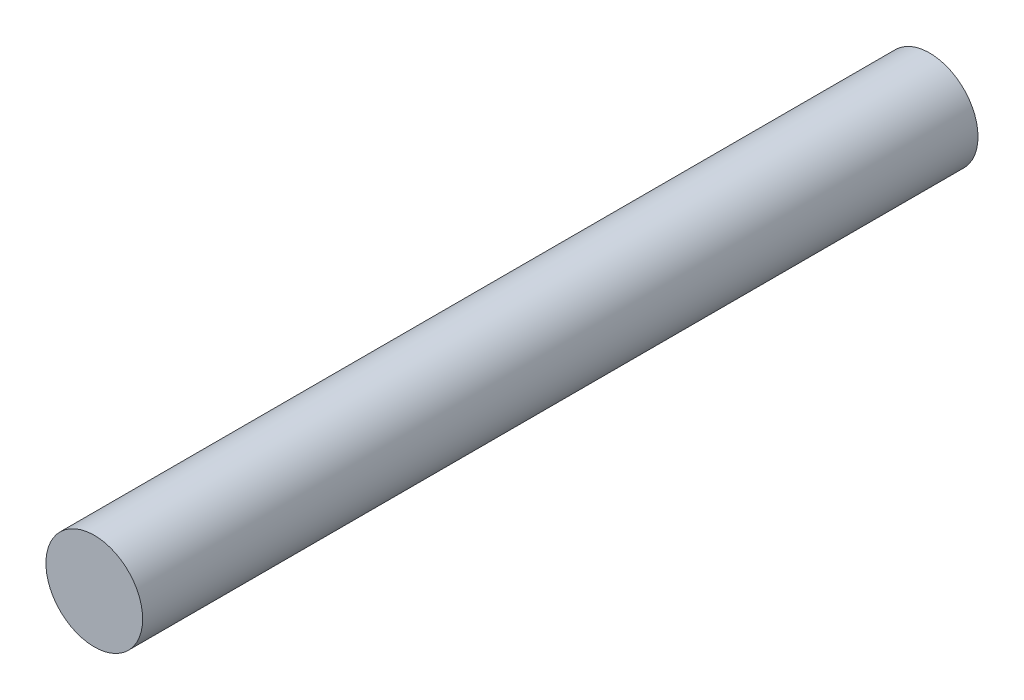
ISO-10303-21;
HEADER;
FILE_DESCRIPTION(('STEP AP214'),'2;1');
FILE_NAME('part.step','',(''),(''),'','','');
FILE_SCHEMA(('AUTOMOTIVE_DESIGN { 1 0 10303 214 1 1 1 1 }'));
ENDSEC;
DATA;
#1=APPLICATION_CONTEXT('core data for automotive mechanical design processes');
#2=APPLICATION_PROTOCOL_DEFINITION('international standard','automotive_design',2000,#1);
#3=PRODUCT_CONTEXT('',#1,'mechanical');
#4=PRODUCT('Part','Part','',(#3));
#5=PRODUCT_RELATED_PRODUCT_CATEGORY('part','',(#4));
#6=PRODUCT_DEFINITION_FORMATION('','',#4);
#7=PRODUCT_DEFINITION_CONTEXT('part definition',#1,'design');
#8=PRODUCT_DEFINITION('design','',#6,#7);
#9=PRODUCT_DEFINITION_SHAPE('','',#8);
#10=(LENGTH_UNIT() NAMED_UNIT(*) SI_UNIT(.MILLI.,.METRE.));
#11=(NAMED_UNIT(*) PLANE_ANGLE_UNIT() SI_UNIT($,.RADIAN.));
#12=(NAMED_UNIT(*) SI_UNIT($,.STERADIAN.) SOLID_ANGLE_UNIT());
#13=UNCERTAINTY_MEASURE_WITH_UNIT(LENGTH_MEASURE(1.E-05),#10,'distance_accuracy_value','');
#14=(GEOMETRIC_REPRESENTATION_CONTEXT(3) GLOBAL_UNCERTAINTY_ASSIGNED_CONTEXT((#13)) GLOBAL_UNIT_ASSIGNED_CONTEXT((#10,
#11,#12)) REPRESENTATION_CONTEXT('',''));
#15=CARTESIAN_POINT('',(0.,0.,0.));
#16=DIRECTION('',(0.,0.,1.));
#17=DIRECTION('',(1.,0.,0.));
#18=AXIS2_PLACEMENT_3D('',#15,#16,#17);
#19=CARTESIAN_POINT('',(0.,0.,19.));
#20=DIRECTION('',(0.,0.,-1.));
#21=DIRECTION('',(-1.,0.,0.));
#22=AXIS2_PLACEMENT_3D('',#19,#20,#21);
#23=CYLINDRICAL_SURFACE('',#22,1.1);
#24=CARTESIAN_POINT('',(0.,0.,19.));
#25=DIRECTION('',(0.,0.,1.));
#26=DIRECTION('',(1.,0.,0.));
#27=AXIS2_PLACEMENT_3D('',#24,#25,#26);
#28=CIRCLE('',#27,1.1);
#29=CARTESIAN_POINT('',(1.1,0.,19.));
#30=VERTEX_POINT('',#29);
#31=EDGE_CURVE('E10',#30,#30,#28,.T.);
#32=ORIENTED_EDGE('',*,*,#31,.F.);
#33=EDGE_LOOP('',(#32));
#34=FACE_BOUND('',#33,.T.);
#35=CARTESIAN_POINT('',(0.,0.,0.));
#36=DIRECTION('',(0.,0.,1.));
#37=DIRECTION('',(1.,0.,0.));
#38=AXIS2_PLACEMENT_3D('',#35,#36,#37);
#39=CIRCLE('',#38,1.1);
#40=CARTESIAN_POINT('',(1.1,0.,0.));
#41=VERTEX_POINT('',#40);
#42=EDGE_CURVE('E36',#41,#41,#39,.T.);
#43=ORIENTED_EDGE('',*,*,#42,.T.);
#44=EDGE_LOOP('',(#43));
#45=FACE_BOUND('',#44,.T.);
#46=ADVANCED_FACE('F33',(#34,#45),#23,.T.);
#47=CARTESIAN_POINT('',(0.,0.,19.));
#48=DIRECTION('',(0.,0.,1.));
#49=DIRECTION('',(1.,0.,0.));
#50=AXIS2_PLACEMENT_3D('',#47,#48,#49);
#51=PLANE('',#50);
#52=ORIENTED_EDGE('',*,*,#31,.T.);
#53=EDGE_LOOP('',(#52));
#54=FACE_BOUND('',#53,.T.);
#55=ADVANCED_FACE('F48',(#54),#51,.T.);
#56=CARTESIAN_POINT('',(0.,0.,0.));
#57=DIRECTION('',(0.,0.,1.));
#58=DIRECTION('',(1.,0.,0.));
#59=AXIS2_PLACEMENT_3D('',#56,#57,#58);
#60=PLANE('',#59);
#61=ORIENTED_EDGE('',*,*,#42,.F.);
#62=EDGE_LOOP('',(#61));
#63=FACE_BOUND('',#62,.T.);
#64=ADVANCED_FACE('F46',(#63),#60,.F.);
#65=CLOSED_SHELL('',(#46,#55,#64));
#66=MANIFOLD_SOLID_BREP('B2',#65);
#67=ADVANCED_BREP_SHAPE_REPRESENTATION('',(#18,#66),#14);
#68=SHAPE_DEFINITION_REPRESENTATION(#9,#67);
ENDSEC;
END-ISO-10303-21;
